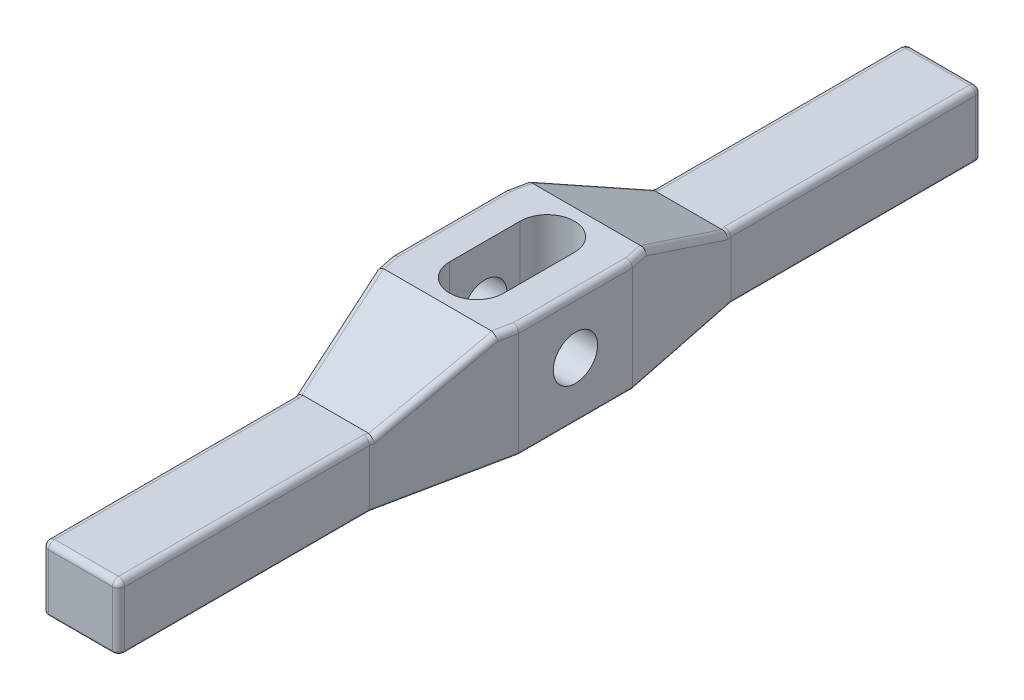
from build123d import *

# Parameters (mm, degrees)
EXTRUDE1_DEPTH     = 27.813
CUT_EXTRUDE1_DEPTH = 116.90870532
SKETCH3_R          = 5.54355
CUT_EXTRUDE2_DEPTH = 116.90870532
FILLET1_R          = 1.524
FILLET2_R          = 0.508
FILLET3_R          = 1.524


with BuildPart() as part:
    # Sketch1 → Extrude1 (new body)
    with BuildSketch(Plane(origin=(0, 0, 0), x_dir=(1, 0, 0), z_dir=(0, 1, 0))):
        Polygon((-9.525, 107.95), (9.525, 107.95), (9.525, 45.212), (15.875, 14.224508), (15.875, -14.224508), (9.525, -45.212), (9.525, -107.95), (-9.525, -107.95), (-9.525, -45.212), (-15.875, -14.224508), (-15.875, 14.224508), (-9.525, 45.212), align=None)
        with BuildLine():
            Line((-6.7818, 8.8265), (-6.7818, -8.8265))
            ThreePointArc((-6.7818, -8.8265), (0, -15.6083), (6.7818, -8.8265))
            Line((6.7818, -8.8265), (6.7818, 8.8265))
            ThreePointArc((6.7818, 8.8265), (0, 15.6083), (-6.7818, 8.8265))
        make_face(mode=Mode.SUBTRACT)
    extrude(amount=EXTRUDE1_DEPTH)

    # Sketch2 → Cut-Extrude1 (cut, through all)
    with BuildSketch(Plane(origin=(15.875, 0, 0), x_dir=(0, 0, -1), z_dir=(1, 0, 0))):
        Polygon((107.95, 27.813), (18.5674, 27.813), (44.168523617, 15.875), (107.95, 15.875), align=None)
        Polygon((-107.95, 15.875), (-107.95, 27.813), (-18.5674, 27.813), (-44.168523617, 15.875), align=None)
    extrude(amount=-CUT_EXTRUDE1_DEPTH, mode=Mode.SUBTRACT)

    # Sketch3 → Cut-Extrude2 (cut, through all)
    with BuildSketch(Plane(origin=(15.875, 0, 0), x_dir=(0, 0, -1), z_dir=(1, 0, 0))):
        with Locations((0, 13.9446)):
            Circle(SKETCH3_R)
    extrude(amount=-CUT_EXTRUDE2_DEPTH, mode=Mode.SUBTRACT)

    # Fillet1
    fillet1_edges = [part.edges().sort_by_distance(p)[0] for p in [
        (-9.525, 7.9375, -107.95),
        (9.525, 7.9375, -107.95),
        (9.525, 7.9375, 107.95),
        (-9.525, 7.9375, 107.95),
    ]]
    fillet(fillet1_edges, radius=FILLET1_R)

    # Fillet2
    fillet2_edges = [part.edges().sort_by_distance(p)[0] for p in [
        (15.875, 0, 0),
        (-9.525, 0, -75.819),
        (12.7, 0, 29.718254),
        (9.525, 0, 75.819),
        (0, 0, 107.95),
        (0, 0, -107.95),
        (-9.078630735, 0, 107.503630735),
        (9.078630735, 0, 107.503630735),
        (9.078630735, 0, -107.503630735),
        (-9.078630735, 0, -107.503630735),
        (-9.525, 0, 75.819),
        (-12.7, 0, 29.718254),
        (-15.875, 0, 0),
        (-12.7, 0, -29.718254),
        (9.525, 0, -75.819),
        (12.7, 0, -29.718254),
    ]]
    fillet(fillet2_edges, radius=FILLET2_R)

    # Fillet3
    fillet3_edges = [part.edges().sort_by_distance(p)[0] for p in [
        (0, 15.875, -107.95),
        (9.525, 15.875, -75.819),
        (9.078630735, 15.875, -107.503630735),
        (-9.078630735, 15.875, -107.503630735),
        (0, 15.875, 107.95),
        (-9.525, 15.875, 75.819),
        (-9.078630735, 15.875, 107.503630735),
        (9.078630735, 15.875, 107.503630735),
        (-15.875, 27.813, 0),
        (-15.430024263, 27.813, 16.395954),
        (15.875, 27.813, 0),
        (15.430024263, 27.813, -16.395954),
        (12.361939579, 21.844, -31.367961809),
        (9.631915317, 15.875, -44.690261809),
        (-15.430024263, 27.813, -16.395954),
        (-9.631915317, 15.875, -44.690261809),
        (-9.525, 15.875, -75.819),
        (-12.361939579, 21.844, -31.367961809),
        (15.430024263, 27.813, 16.395954),
        (12.361939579, 21.844, 31.367961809),
        (9.631915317, 15.875, 44.690261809),
        (-9.631915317, 15.875, 44.690261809),
        (9.525, 15.875, 75.819),
        (-12.361939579, 21.844, 31.367961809),
    ]]
    fillet(fillet3_edges, radius=FILLET3_R)


solid = part.part
